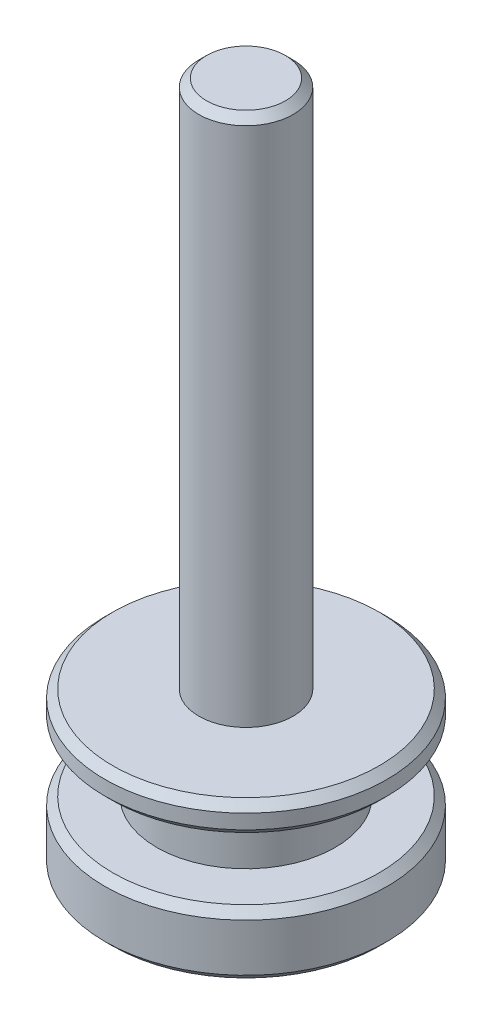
from build123d import *

# Parameters (mm, degrees)
SKETCH1_R           = 7.112
BOSS_EXTRUDE1_DEPTH = 3.2004
SKETCH2_R           = 4.5
BOSS_EXTRUDE2_DEPTH = 3.1496
SKETCH3_R           = 7.112
BOSS_EXTRUDE3_DEPTH = 1.524
SKETCH4_R           = 2.38125
BOSS_EXTRUDE4_DEPTH = 26.67
CHAMFER1_SIZE       = 0.396875


with BuildPart() as part:
    # Sketch1 → Boss-Extrude1 (new body)
    with BuildSketch(Plane(origin=(0, 0, 0), x_dir=(1, 0, 0), z_dir=(0, 1, 0))):
        with Locations(Location((0, 0, 0), (0, 0, 270))):
            Circle(SKETCH1_R)
    extrude(amount=BOSS_EXTRUDE1_DEPTH)

    # Sketch2 → Boss-Extrude2 (add)
    with BuildSketch(Plane(origin=(0, 3.2004, 0), x_dir=(1, 0, 0), z_dir=(0, 1, 0))):
        with Locations(Location((0, 0, 0), (0, 0, 270))):
            Circle(SKETCH2_R)
    extrude(amount=BOSS_EXTRUDE2_DEPTH)

    # Sketch3 → Boss-Extrude3 (add)
    with BuildSketch(Plane(origin=(0, 6.35, 0), x_dir=(1, 0, 0), z_dir=(0, 1, 0))):
        with Locations(Location((0, 0, 0), (0, 0, 270))):
            Circle(SKETCH3_R)
    extrude(amount=BOSS_EXTRUDE3_DEPTH)

    # Sketch4 → Boss-Extrude4 (add)
    with BuildSketch(Plane(origin=(0, 7.874, 0), x_dir=(1, 0, 0), z_dir=(0, 1, 0))):
        with Locations(Location((0, 0, 0), (0, 0, 270))):
            Circle(SKETCH4_R)
    extrude(amount=BOSS_EXTRUDE4_DEPTH)

    # Chamfer1
    chamfer1_edges = [part.edges().sort_by_distance(p)[0] for p in [
        (0, 34.544, -2.38125),
        (0, 0, -7.112),
        (0, 3.2004, -7.112),
        (0, 6.35, -7.112),
        (0, 7.874, -7.112),
    ]]
    chamfer(chamfer1_edges, length=CHAMFER1_SIZE)


solid = part.part
